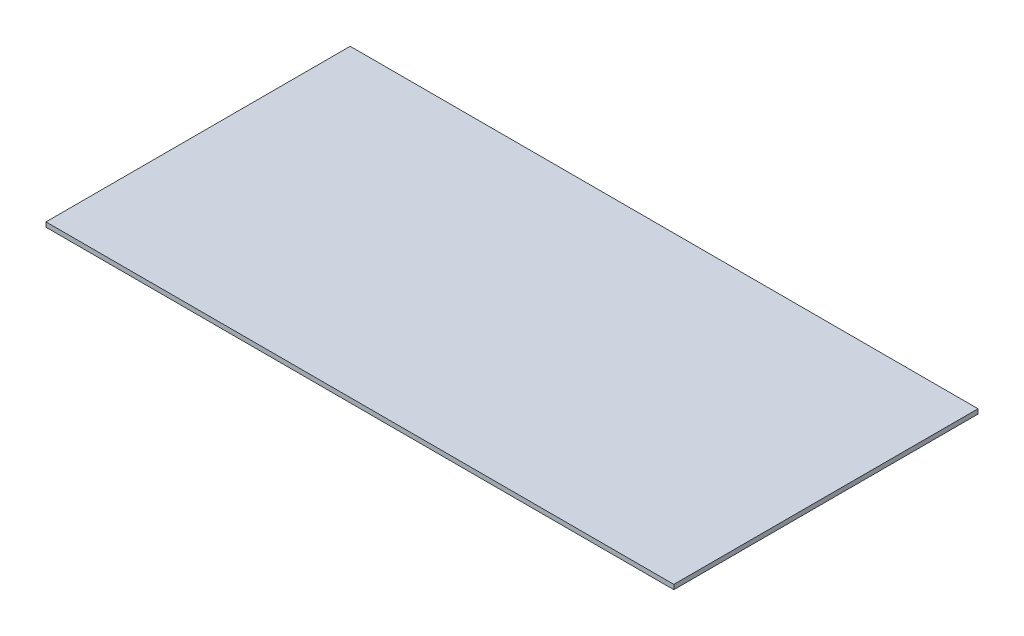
from build123d import *

# Parameters (mm, degrees)
ESQUISSE1_W        = 404.56
ESQUISSE1_H        = 196
BOSS_EXTRU_1_DEPTH = 3


with BuildPart() as part:
    # Esquisse1 → Boss.-Extru.1 (new body)
    with BuildSketch(Plane(origin=(0, 0, 0), x_dir=(1, 0, 0), z_dir=(0, 1, 0))):
        with Locations((202.28, 98)):
            Rectangle(ESQUISSE1_W, ESQUISSE1_H)
    extrude(amount=BOSS_EXTRU_1_DEPTH)


solid = part.part
